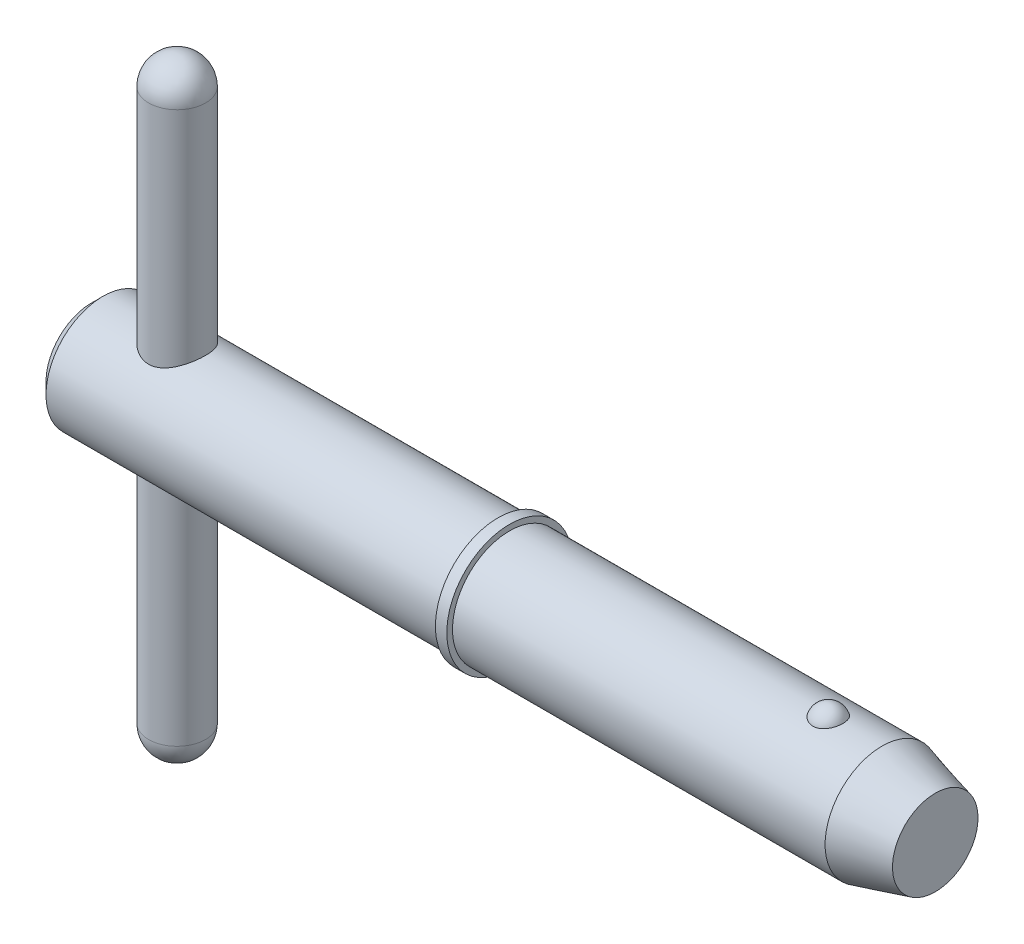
ISO-10303-21;
HEADER;
FILE_DESCRIPTION(('STEP AP214'),'2;1');
FILE_NAME('part.step','',(''),(''),'','','');
FILE_SCHEMA(('AUTOMOTIVE_DESIGN { 1 0 10303 214 1 1 1 1 }'));
ENDSEC;
DATA;
#1=APPLICATION_CONTEXT('core data for automotive mechanical design processes');
#2=APPLICATION_PROTOCOL_DEFINITION('international standard','automotive_design',2000,#1);
#3=PRODUCT_CONTEXT('',#1,'mechanical');
#4=PRODUCT('Part','Part','',(#3));
#5=PRODUCT_RELATED_PRODUCT_CATEGORY('part','',(#4));
#6=PRODUCT_DEFINITION_FORMATION('','',#4);
#7=PRODUCT_DEFINITION_CONTEXT('part definition',#1,'design');
#8=PRODUCT_DEFINITION('design','',#6,#7);
#9=PRODUCT_DEFINITION_SHAPE('','',#8);
#10=(LENGTH_UNIT() NAMED_UNIT(*) SI_UNIT(.MILLI.,.METRE.));
#11=(NAMED_UNIT(*) PLANE_ANGLE_UNIT() SI_UNIT($,.RADIAN.));
#12=(NAMED_UNIT(*) SI_UNIT($,.STERADIAN.) SOLID_ANGLE_UNIT());
#13=UNCERTAINTY_MEASURE_WITH_UNIT(LENGTH_MEASURE(1.E-05),#10,'distance_accuracy_value','');
#14=(GEOMETRIC_REPRESENTATION_CONTEXT(3) GLOBAL_UNCERTAINTY_ASSIGNED_CONTEXT((#13)) GLOBAL_UNIT_ASSIGNED_CONTEXT((#10,
#11,#12)) REPRESENTATION_CONTEXT('',''));
#15=CARTESIAN_POINT('',(0.,0.,0.));
#16=DIRECTION('',(0.,0.,1.));
#17=DIRECTION('',(1.,0.,0.));
#18=AXIS2_PLACEMENT_3D('',#15,#16,#17);
#19=CARTESIAN_POINT('',(3.57,12.7,0.));
#20=DIRECTION('',(0.,-1.,0.));
#21=DIRECTION('',(0.,0.,-1.));
#22=AXIS2_PLACEMENT_3D('',#19,#20,#21);
#23=CYLINDRICAL_SURFACE('',#22,1.19);
#24=CARTESIAN_POINT('',(3.57,-11.51,0.));
#25=DIRECTION('',(0.,-1.,0.));
#26=DIRECTION('',(0.,0.,-1.));
#27=AXIS2_PLACEMENT_3D('',#24,#25,#26);
#28=CIRCLE('',#27,1.19);
#29=CARTESIAN_POINT('',(3.57,-11.51,-1.19));
#30=VERTEX_POINT('',#29);
#31=EDGE_CURVE('P0_E10',#30,#30,#28,.F.);
#32=ORIENTED_EDGE('',*,*,#31,.T.);
#33=EDGE_LOOP('',(#32));
#34=FACE_BOUND('',#33,.T.);
#35=CARTESIAN_POINT('',(3.57,11.51,0.));
#36=DIRECTION('',(0.,-1.,0.));
#37=DIRECTION('',(0.,0.,-1.));
#38=AXIS2_PLACEMENT_3D('',#35,#36,#37);
#39=CIRCLE('',#38,1.19);
#40=CARTESIAN_POINT('',(3.57,11.51,-1.19));
#41=VERTEX_POINT('',#40);
#42=EDGE_CURVE('P0_E21',#41,#41,#39,.T.);
#43=ORIENTED_EDGE('',*,*,#42,.T.);
#44=EDGE_LOOP('',(#43));
#45=FACE_BOUND('',#44,.T.);
#46=ADVANCED_FACE('P0_F14',(#34,#45),#23,.T.);
#47=CARTESIAN_POINT('',(3.57,-11.51,0.));
#48=DIRECTION('',(0.,0.,1.));
#49=DIRECTION('',(1.,0.,0.));
#50=AXIS2_PLACEMENT_3D('',#47,#48,#49);
#51=SPHERICAL_SURFACE('',#50,1.19);
#52=CARTESIAN_POINT('',(3.57,-11.51,0.));
#53=DIRECTION('',(0.,-1.,0.));
#54=DIRECTION('',(0.,0.,-1.));
#55=AXIS2_PLACEMENT_3D('',#52,#53,#54);
#56=SPHERICAL_SURFACE('',#55,1.19);
#57=ORIENTED_EDGE('',*,*,#31,.F.);
#58=EDGE_LOOP('',(#57));
#59=FACE_BOUND('',#58,.T.);
#60=ADVANCED_FACE('P0_F29',(#59),#56,.T.);
#61=CARTESIAN_POINT('',(3.57,11.51,0.));
#62=DIRECTION('',(0.,0.,1.));
#63=DIRECTION('',(1.,0.,0.));
#64=AXIS2_PLACEMENT_3D('',#61,#62,#63);
#65=SPHERICAL_SURFACE('',#64,1.19);
#66=CARTESIAN_POINT('',(3.57,11.51,0.));
#67=DIRECTION('',(0.,-1.,0.));
#68=DIRECTION('',(0.,0.,-1.));
#69=AXIS2_PLACEMENT_3D('',#66,#67,#68);
#70=SPHERICAL_SURFACE('',#69,1.19);
#71=ORIENTED_EDGE('',*,*,#42,.F.);
#72=EDGE_LOOP('',(#71));
#73=FACE_BOUND('',#72,.T.);
#74=ADVANCED_FACE('P0_F16',(#73),#70,.T.);
#75=CLOSED_SHELL('',(#46,#60,#74));
#76=MANIFOLD_SOLID_BREP('P0_B1',#75);
#77=CARTESIAN_POINT('',(0.,0.,0.));
#78=DIRECTION('',(1.,0.,0.));
#79=DIRECTION('',(0.,0.,-1.));
#80=AXIS2_PLACEMENT_3D('',#77,#78,#79);
#81=CYLINDRICAL_SURFACE('',#80,2.38);
#82=CARTESIAN_POINT('',(33.0094297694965,0.,0.));
#83=DIRECTION('',(1.,0.,0.));
#84=DIRECTION('',(0.,0.,-1.));
#85=AXIS2_PLACEMENT_3D('',#82,#83,#84);
#86=CIRCLE('',#85,2.38);
#87=CARTESIAN_POINT('',(33.0094297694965,0.,-2.38));
#88=VERTEX_POINT('',#87);
#89=EDGE_CURVE('P1_E81',#88,#88,#86,.T.);
#90=ORIENTED_EDGE('',*,*,#89,.F.);
#91=EDGE_LOOP('',(#90));
#92=FACE_BOUND('',#91,.T.);
#93=CARTESIAN_POINT('',(17.45,0.,0.));
#94=DIRECTION('',(1.,0.,0.));
#95=DIRECTION('',(0.,0.,-1.));
#96=AXIS2_PLACEMENT_3D('',#93,#94,#95);
#97=CIRCLE('',#96,2.38);
#98=CARTESIAN_POINT('',(17.45,0.,-2.38));
#99=VERTEX_POINT('',#98);
#100=EDGE_CURVE('P1_E85',#99,#99,#97,.T.);
#101=ORIENTED_EDGE('',*,*,#100,.T.);
#102=EDGE_LOOP('',(#101));
#103=FACE_BOUND('',#102,.T.);
#104=CARTESIAN_POINT('',(30.7634492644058,2.2921568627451,0.640637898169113));
#105=CARTESIAN_POINT('',(30.7303559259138,2.29215737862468,0.640637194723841));
#106=CARTESIAN_POINT('',(30.6972546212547,2.29293179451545,0.637884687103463));
#107=CARTESIAN_POINT('',(30.6320176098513,2.29594030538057,0.626968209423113));
#108=CARTESIAN_POINT('',(30.5998823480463,2.29817506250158,0.618801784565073));
#109=CARTESIAN_POINT('',(30.5375402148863,2.3038430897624,0.597351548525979));
#110=CARTESIAN_POINT('',(30.5073305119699,2.30727454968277,0.584075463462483));
#111=CARTESIAN_POINT('',(30.4495674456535,2.31495941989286,0.552829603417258));
#112=CARTESIAN_POINT('',(30.4220141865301,2.31921286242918,0.534859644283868));
#113=CARTESIAN_POINT('',(30.3695938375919,2.32820213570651,0.494282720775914));
#114=CARTESIAN_POINT('',(30.3448050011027,2.33294694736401,0.471576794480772));
#115=CARTESIAN_POINT('',(30.2992169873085,2.34234144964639,0.422446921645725));
#116=CARTESIAN_POINT('',(30.2784185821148,2.34699112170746,0.396022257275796));
#117=CARTESIAN_POINT('',(30.2403580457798,2.35593942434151,0.338855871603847));
#118=CARTESIAN_POINT('',(30.2233051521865,2.36021170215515,0.307970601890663));
#119=CARTESIAN_POINT('',(30.1943607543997,2.3677057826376,0.243750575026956));
#120=CARTESIAN_POINT('',(30.1824701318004,2.37092740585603,0.210415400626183));
#121=CARTESIAN_POINT('',(30.1638076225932,2.37606901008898,0.141189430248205));
#122=CARTESIAN_POINT('',(30.1571956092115,2.37794816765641,0.105252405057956));
#123=CARTESIAN_POINT('',(30.1498095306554,2.38005135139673,0.0327351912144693));
#124=CARTESIAN_POINT('',(30.1490358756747,2.38027526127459,-0.00384504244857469));
#125=CARTESIAN_POINT('',(30.1533628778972,2.37903842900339,-0.0769838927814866));
#126=CARTESIAN_POINT('',(30.1585202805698,2.37756141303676,-0.113538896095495));
#127=CARTESIAN_POINT('',(30.1747013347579,2.37305303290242,-0.185229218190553));
#128=CARTESIAN_POINT('',(30.1857251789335,2.37002161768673,-0.220364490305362));
#129=CARTESIAN_POINT('',(30.2133977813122,2.36273722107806,-0.288156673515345));
#130=CARTESIAN_POINT('',(30.2300389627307,2.35848588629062,-0.320816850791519));
#131=CARTESIAN_POINT('',(30.2685984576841,2.34923130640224,-0.382744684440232));
#132=CARTESIAN_POINT('',(30.290516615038,2.34422808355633,-0.412012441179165));
#133=CARTESIAN_POINT('',(30.3387549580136,2.33412555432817,-0.465830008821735));
#134=CARTESIAN_POINT('',(30.3650028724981,2.32902887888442,-0.490444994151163));
#135=CARTESIAN_POINT('',(30.4214769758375,2.31926941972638,-0.534700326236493));
#136=CARTESIAN_POINT('',(30.451702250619,2.3146065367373,-0.554341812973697));
#137=CARTESIAN_POINT('',(30.5140618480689,2.30645675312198,-0.587312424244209));
#138=CARTESIAN_POINT('',(30.5460780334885,2.30293152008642,-0.600855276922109));
#139=CARTESIAN_POINT('',(30.6120795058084,2.29725171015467,-0.622220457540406));
#140=CARTESIAN_POINT('',(30.6460641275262,2.29509667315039,-0.630044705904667));
#141=CARTESIAN_POINT('',(30.713299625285,2.29249264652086,-0.639452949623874));
#142=CARTESIAN_POINT('',(30.7465087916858,2.29196755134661,-0.641315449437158));
#143=CARTESIAN_POINT('',(30.812763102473,2.29246849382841,-0.639522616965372));
#144=CARTESIAN_POINT('',(30.8458082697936,2.29349430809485,-0.635868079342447));
#145=CARTESIAN_POINT('',(30.9101025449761,2.29694059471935,-0.623301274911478));
#146=CARTESIAN_POINT('',(30.9413744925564,2.29933234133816,-0.614497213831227));
#147=CARTESIAN_POINT('',(31.0019952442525,2.30522511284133,-0.592006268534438));
#148=CARTESIAN_POINT('',(31.0313438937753,2.30872622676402,-0.57831899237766));
#149=CARTESIAN_POINT('',(31.0880369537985,2.31655795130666,-0.546112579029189));
#150=CARTESIAN_POINT('',(31.115320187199,2.32090569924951,-0.527490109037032));
#151=CARTESIAN_POINT('',(31.1664904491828,2.32992206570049,-0.486117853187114));
#152=CARTESIAN_POINT('',(31.1903767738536,2.33459075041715,-0.463367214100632));
#153=CARTESIAN_POINT('',(31.2352722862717,2.34399834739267,-0.413220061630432));
#154=CARTESIAN_POINT('',(31.2560972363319,2.34873051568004,-0.385657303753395));
#155=CARTESIAN_POINT('',(31.293056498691,2.35754932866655,-0.327455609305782));
#156=CARTESIAN_POINT('',(31.3091898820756,2.36163584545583,-0.296816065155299));
#157=CARTESIAN_POINT('',(31.3369822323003,2.36889321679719,-0.232047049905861));
#158=CARTESIAN_POINT('',(31.3484450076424,2.37202275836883,-0.197828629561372));
#159=CARTESIAN_POINT('',(31.3657523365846,2.37681926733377,-0.127900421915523));
#160=CARTESIAN_POINT('',(31.3715962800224,2.37848607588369,-0.0921904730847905));
#161=CARTESIAN_POINT('',(31.377605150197,2.38020024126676,-0.0196348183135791));
#162=CARTESIAN_POINT('',(31.3776704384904,2.38021918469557,0.0172198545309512));
#163=CARTESIAN_POINT('',(31.3718689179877,2.37856356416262,0.0904219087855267));
#164=CARTESIAN_POINT('',(31.3660018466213,2.37688892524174,0.12676926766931));
#165=CARTESIAN_POINT('',(31.348425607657,2.37201688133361,0.198028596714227));
#166=CARTESIAN_POINT('',(31.3366998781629,2.36881516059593,0.232936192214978));
#167=CARTESIAN_POINT('',(31.3076354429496,2.36123444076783,0.300196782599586));
#168=CARTESIAN_POINT('',(31.2902967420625,2.3568554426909,0.332549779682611));
#169=CARTESIAN_POINT('',(31.2505350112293,2.34744667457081,0.393495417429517));
#170=CARTESIAN_POINT('',(31.2281528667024,2.34242227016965,0.422115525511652));
#171=CARTESIAN_POINT('',(31.1787391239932,2.33227293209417,0.475004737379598));
#172=CARTESIAN_POINT('',(31.1517076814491,2.32714800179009,0.499273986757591));
#173=CARTESIAN_POINT('',(31.0944988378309,2.31755359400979,0.542046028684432));
#174=CARTESIAN_POINT('',(31.0644297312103,2.3130698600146,0.560690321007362));
#175=CARTESIAN_POINT('',(31.0013869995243,2.30514125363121,0.592447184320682));
#176=CARTESIAN_POINT('',(30.9684158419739,2.30169550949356,0.605564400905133));
#177=CARTESIAN_POINT('',(30.9068424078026,2.29677744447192,0.623927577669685));
#178=CARTESIAN_POINT('',(30.8785555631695,2.295058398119,0.630178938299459));
#179=CARTESIAN_POINT('',(30.8213308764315,2.29274795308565,0.638534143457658));
#180=CARTESIAN_POINT('',(30.7923931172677,2.29215641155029,0.640638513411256));
#181=CARTESIAN_POINT('',(30.7634492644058,2.2921568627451,0.640637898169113));
#182=B_SPLINE_CURVE_WITH_KNOTS('',3,(#104,#105,#106,#107,#108,#109,#110,#111,#112,#113,#114,
#115,#116,#117,#118,#119,#120,#121,#122,#123,#124,#125,#126,#127,#128,#129,#130,#131,#132,#133,
#134,#135,#136,#137,#138,#139,#140,#141,#142,#143,#144,#145,#146,#147,#148,#149,#150,#151,#152,
#153,#154,#155,#156,#157,#158,#159,#160,#161,#162,#163,#164,#165,#166,#167,#168,#169,#170,#171,
#172,#173,#174,#175,#176,#177,#178,#179,#180,#181),.UNSPECIFIED.,.T.,.F.,(4,2,2,2,2,2,2,2,2,2,2,
2,2,2,2,2,2,2,2,2,2,2,2,2,2,2,2,2,2,2,2,2,2,2,2,2,2,2,4),(0.,0.0991724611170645,
0.19838992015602,0.297457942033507,0.396529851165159,0.49792776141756,0.599345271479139,
0.705475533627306,0.811623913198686,0.920876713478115,1.03013718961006,1.14045177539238,
1.25076998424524,1.36093998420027,1.47110672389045,1.57959248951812,1.68805336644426,
1.79234266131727,1.89659691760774,1.99590391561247,2.09519661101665,2.19247425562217,
2.28975970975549,2.38926978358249,2.48880044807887,2.59293588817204,2.69709193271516,
2.80525821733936,2.91343624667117,3.02347917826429,3.13352698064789,3.24388765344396,
3.35424823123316,3.46374443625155,3.5732369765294,3.67968690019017,3.78604717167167,
3.87279565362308,3.9595331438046),.UNSPECIFIED.);
#183=CARTESIAN_POINT('',(30.7634492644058,2.2921568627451,0.640637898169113));
#184=VERTEX_POINT('',#183);
#185=EDGE_CURVE('P1_E35',#184,#184,#182,.T.);
#186=ORIENTED_EDGE('',*,*,#185,.T.);
#187=EDGE_LOOP('',(#186));
#188=FACE_BOUND('',#187,.T.);
#189=ADVANCED_FACE('P1_F13',(#92,#103,#188),#81,.T.);
#190=CARTESIAN_POINT('',(0.,0.,0.));
#191=DIRECTION('',(-1.,0.,0.));
#192=DIRECTION('',(0.,0.,1.));
#193=AXIS2_PLACEMENT_3D('',#190,#191,#192);
#194=PLANE('',#193);
#195=CARTESIAN_POINT('',(0.,0.,0.));
#196=DIRECTION('',(1.,0.,0.));
#197=DIRECTION('',(0.,0.,-1.));
#198=AXIS2_PLACEMENT_3D('',#195,#196,#197);
#199=CIRCLE('',#198,1.904);
#200=CARTESIAN_POINT('',(0.,0.,-1.904));
#201=VERTEX_POINT('',#200);
#202=EDGE_CURVE('P1_E9',#201,#201,#199,.T.);
#203=ORIENTED_EDGE('',*,*,#202,.F.);
#204=EDGE_LOOP('',(#203));
#205=FACE_BOUND('',#204,.T.);
#206=ADVANCED_FACE('P1_F15',(#205),#194,.T.);
#207=CARTESIAN_POINT('',(0.475999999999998,0.,0.));
#208=DIRECTION('',(1.,0.,0.));
#209=DIRECTION('',(0.,0.,-1.));
#210=AXIS2_PLACEMENT_3D('',#207,#208,#209);
#211=CONICAL_SURFACE('',#210,2.38,0.78539816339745);
#212=ORIENTED_EDGE('',*,*,#202,.T.);
#213=EDGE_LOOP('',(#212));
#214=FACE_BOUND('',#213,.T.);
#215=CARTESIAN_POINT('',(0.475999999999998,0.,0.));
#216=DIRECTION('',(1.,0.,0.));
#217=DIRECTION('',(0.,0.,-1.));
#218=AXIS2_PLACEMENT_3D('',#215,#216,#217);
#219=CIRCLE('',#218,2.38);
#220=CARTESIAN_POINT('',(0.475999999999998,0.,-2.38));
#221=VERTEX_POINT('',#220);
#222=EDGE_CURVE('P1_E26',#221,#221,#219,.T.);
#223=ORIENTED_EDGE('',*,*,#222,.F.);
#224=EDGE_LOOP('',(#223));
#225=FACE_BOUND('',#224,.T.);
#226=ADVANCED_FACE('P1_F77',(#214,#225),#211,.T.);
#227=CARTESIAN_POINT('',(0.,0.,0.));
#228=DIRECTION('',(1.,0.,0.));
#229=DIRECTION('',(0.,0.,-1.));
#230=AXIS2_PLACEMENT_3D('',#227,#228,#229);
#231=CYLINDRICAL_SURFACE('',#230,2.38);
#232=CARTESIAN_POINT('',(3.57,-2.06114046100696,1.19));
#233=CARTESIAN_POINT('',(3.50799170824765,-2.06114586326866,1.18999567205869));
#234=CARTESIAN_POINT('',(3.4459051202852,-2.0639812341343,1.18512096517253));
#235=CARTESIAN_POINT('',(3.32363755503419,-2.07491216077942,1.16587061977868));
#236=CARTESIAN_POINT('',(3.26346086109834,-2.08301876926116,1.15147501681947));
#237=CARTESIAN_POINT('',(3.14701251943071,-2.10331722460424,1.11395893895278));
#238=CARTESIAN_POINT('',(3.09072196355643,-2.1154873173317,1.09088484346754));
#239=CARTESIAN_POINT('',(2.9828251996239,-2.14250771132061,1.03680835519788));
#240=CARTESIAN_POINT('',(2.93121924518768,-2.15735815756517,1.00580553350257));
#241=CARTESIAN_POINT('',(2.82945618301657,-2.18956274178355,0.933753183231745));
#242=CARTESIAN_POINT('',(2.77976962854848,-2.20702235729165,0.892085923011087));
#243=CARTESIAN_POINT('',(2.68772401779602,-2.2416265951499,0.801172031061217));
#244=CARTESIAN_POINT('',(2.64536861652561,-2.25877105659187,0.751921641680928));
#245=CARTESIAN_POINT('',(2.56639309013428,-2.29219557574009,0.64318258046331));
#246=CARTESIAN_POINT('',(2.53035201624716,-2.30833946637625,0.583227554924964));
#247=CARTESIAN_POINT('',(2.46908238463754,-2.3365739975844,0.45714686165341));
#248=CARTESIAN_POINT('',(2.44384700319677,-2.34866719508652,0.391025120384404));
#249=CARTESIAN_POINT('',(2.40676945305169,-2.36667748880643,0.259473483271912));
#250=CARTESIAN_POINT('',(2.39410206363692,-2.37297281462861,0.194329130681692));
#251=CARTESIAN_POINT('',(2.3798023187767,-2.3800902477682,0.0625590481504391));
#252=CARTESIAN_POINT('',(2.37816328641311,-2.38091566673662,-0.00406576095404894));
#253=CARTESIAN_POINT('',(2.38564854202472,-2.37717948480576,-0.130700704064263));
#254=CARTESIAN_POINT('',(2.39384923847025,-2.37308010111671,-0.190782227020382));
#255=CARTESIAN_POINT('',(2.41912820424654,-2.360653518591,-0.308583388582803));
#256=CARTESIAN_POINT('',(2.43620713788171,-2.35232600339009,-0.366302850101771));
#257=CARTESIAN_POINT('',(2.47886825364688,-2.33206184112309,-0.478748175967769));
#258=CARTESIAN_POINT('',(2.50456481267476,-2.32007685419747,-0.533421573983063));
#259=CARTESIAN_POINT('',(2.56357346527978,-2.29357798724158,-0.637812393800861));
#260=CARTESIAN_POINT('',(2.5968882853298,-2.27906320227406,-0.687528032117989));
#261=CARTESIAN_POINT('',(2.67380546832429,-2.24724829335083,-0.785606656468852));
#262=CARTESIAN_POINT('',(2.71808260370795,-2.22981457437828,-0.833397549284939));
#263=CARTESIAN_POINT('',(2.81386177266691,-2.19500665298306,-0.921184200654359));
#264=CARTESIAN_POINT('',(2.86536931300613,-2.17763250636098,-0.961173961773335));
#265=CARTESIAN_POINT('',(2.97815134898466,-2.14371545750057,-1.03471134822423));
#266=CARTESIAN_POINT('',(3.03983836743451,-2.12729540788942,-1.06768860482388));
#267=CARTESIAN_POINT('',(3.16889582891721,-2.09886785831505,-1.12254974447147));
#268=CARTESIAN_POINT('',(3.2362602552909,-2.0868557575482,-1.14444520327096));
#269=CARTESIAN_POINT('',(3.36914526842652,-2.06994116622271,-1.1747444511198));
#270=CARTESIAN_POINT('',(3.43438893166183,-2.06455070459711,-1.18407989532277));
#271=CARTESIAN_POINT('',(3.56571759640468,-2.06010324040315,-1.1918051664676));
#272=CARTESIAN_POINT('',(3.63180197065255,-2.06104176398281,-1.19020272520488));
#273=CARTESIAN_POINT('',(3.75522816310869,-2.06862860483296,-1.17695289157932));
#274=CARTESIAN_POINT('',(3.81273554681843,-2.07464109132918,-1.16642350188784));
#275=CARTESIAN_POINT('',(3.92505766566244,-2.09075885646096,-1.1372785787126));
#276=CARTESIAN_POINT('',(3.97987152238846,-2.1008654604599,-1.1186604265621));
#277=CARTESIAN_POINT('',(4.08813948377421,-2.12458104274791,-1.07296063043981));
#278=CARTESIAN_POINT('',(4.14141303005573,-2.13833055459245,-1.04552693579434));
#279=CARTESIAN_POINT('',(4.2429084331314,-2.16765782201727,-0.983281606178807));
#280=CARTESIAN_POINT('',(4.29112767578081,-2.18323651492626,-0.948466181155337));
#281=CARTESIAN_POINT('',(4.38750473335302,-2.2168271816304,-0.867316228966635));
#282=CARTESIAN_POINT('',(4.43488860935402,-2.23489833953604,-0.82008287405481));
#283=CARTESIAN_POINT('',(4.52130056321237,-2.26973739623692,-0.718051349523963));
#284=CARTESIAN_POINT('',(4.56032581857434,-2.28650485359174,-0.663250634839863));
#285=CARTESIAN_POINT('',(4.62978273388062,-2.31742220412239,-0.545657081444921));
#286=CARTESIAN_POINT('',(4.65996041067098,-2.33149133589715,-0.482691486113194));
#287=CARTESIAN_POINT('',(4.7089941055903,-2.35481192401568,-0.351671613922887));
#288=CARTESIAN_POINT('',(4.7278600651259,-2.36406760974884,-0.283621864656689));
#289=CARTESIAN_POINT('',(4.75210859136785,-2.3760433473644,-0.151105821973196));
#290=CARTESIAN_POINT('',(4.75856947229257,-2.37928514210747,-0.0868836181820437));
#291=CARTESIAN_POINT('',(4.76100348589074,-2.38050135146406,0.0417999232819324));
#292=CARTESIAN_POINT('',(4.75698028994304,-2.37847760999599,0.106261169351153));
#293=CARTESIAN_POINT('',(4.73927447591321,-2.36969422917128,0.229120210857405));
#294=CARTESIAN_POINT('',(4.72624582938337,-2.36325544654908,0.287637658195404));
#295=CARTESIAN_POINT('',(4.69178087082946,-2.34658591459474,0.401560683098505));
#296=CARTESIAN_POINT('',(4.67034335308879,-2.33635462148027,0.456965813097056));
#297=CARTESIAN_POINT('',(4.61871480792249,-2.31247857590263,0.565753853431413));
#298=CARTESIAN_POINT('',(4.58818860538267,-2.29870654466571,0.618948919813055));
#299=CARTESIAN_POINT('',(4.51967006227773,-2.26918878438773,0.719681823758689));
#300=CARTESIAN_POINT('',(4.48167429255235,-2.25344215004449,0.76721704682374));
#301=CARTESIAN_POINT('',(4.39491140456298,-2.21969046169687,0.860267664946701));
#302=CARTESIAN_POINT('',(4.34544863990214,-2.20161660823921,0.905111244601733));
#303=CARTESIAN_POINT('',(4.23943364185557,-2.16655060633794,0.986109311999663));
#304=CARTESIAN_POINT('',(4.18287520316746,-2.1495594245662,1.02225611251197));
#305=CARTESIAN_POINT('',(4.06190239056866,-2.1181953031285,1.08579298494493));
#306=CARTESIAN_POINT('',(3.9972962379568,-2.10392207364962,1.11287022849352));
#307=CARTESIAN_POINT('',(3.86353443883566,-2.08090726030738,1.15534566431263));
#308=CARTESIAN_POINT('',(3.7943948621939,-2.07214719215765,1.17078291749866));
#309=CARTESIAN_POINT('',(3.69875162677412,-2.06499834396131,1.18329673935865));
#310=CARTESIAN_POINT('',(3.67309220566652,-2.06355673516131,1.18580656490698));
#311=CARTESIAN_POINT('',(3.62162638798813,-2.06162663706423,1.18915915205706));
#312=CARTESIAN_POINT('',(3.59581998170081,-2.0611382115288,1.19000180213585));
#313=CARTESIAN_POINT('',(3.57,-2.06114046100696,1.19));
#314=B_SPLINE_CURVE_WITH_KNOTS('',3,(#232,#233,#234,#235,#236,#237,#238,#239,#240,#241,#242,
#243,#244,#245,#246,#247,#248,#249,#250,#251,#252,#253,#254,#255,#256,#257,#258,#259,#260,#261,
#262,#263,#264,#265,#266,#267,#268,#269,#270,#271,#272,#273,#274,#275,#276,#277,#278,#279,#280,
#281,#282,#283,#284,#285,#286,#287,#288,#289,#290,#291,#292,#293,#294,#295,#296,#297,#298,#299,
#300,#301,#302,#303,#304,#305,#306,#307,#308,#309,#310,#311,#312,#313),.UNSPECIFIED.,.T.,.F.,(4,
2,2,2,2,2,2,2,2,2,2,2,2,2,2,2,2,2,2,2,2,2,2,2,2,2,2,2,2,2,2,2,2,2,2,2,2,2,2,2,4),(0.,
0.185916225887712,0.372223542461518,0.557549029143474,0.742884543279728,0.943506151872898,
1.14422749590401,1.35847891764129,1.5725948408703,1.77147547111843,1.97023568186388,
2.15171156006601,2.33320101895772,2.51720146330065,2.70126786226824,2.902733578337,
3.10435357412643,3.31877721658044,3.53297641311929,3.73020126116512,3.92728670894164,
4.1028127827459,4.27839572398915,4.46211082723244,4.64592048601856,4.8529002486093,
5.0599497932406,5.27246375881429,5.48479067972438,5.67763601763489,5.87041383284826,
6.05048865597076,6.23058930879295,6.41839293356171,6.60628297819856,6.8128718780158,
7.01964271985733,7.2329479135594,7.44553408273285,7.52294360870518,7.60035831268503),.UNSPECIFIED.);
#315=CARTESIAN_POINT('',(3.57,-2.06114046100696,1.19));
#316=VERTEX_POINT('',#315);
#317=EDGE_CURVE('P1_E17',#316,#316,#314,.T.);
#318=ORIENTED_EDGE('',*,*,#317,.F.);
#319=EDGE_LOOP('',(#318));
#320=FACE_BOUND('',#319,.T.);
#321=CARTESIAN_POINT('',(3.57,2.06114046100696,1.19));
#322=CARTESIAN_POINT('',(3.63200829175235,2.06114586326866,1.18999567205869));
#323=CARTESIAN_POINT('',(3.6940948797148,2.0639812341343,1.18512096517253));
#324=CARTESIAN_POINT('',(3.81636244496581,2.07491216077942,1.16587061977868));
#325=CARTESIAN_POINT('',(3.87653913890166,2.08301876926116,1.15147501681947));
#326=CARTESIAN_POINT('',(3.99298748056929,2.10331722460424,1.11395893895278));
#327=CARTESIAN_POINT('',(4.04927803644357,2.1154873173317,1.09088484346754));
#328=CARTESIAN_POINT('',(4.1571748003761,2.14250771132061,1.03680835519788));
#329=CARTESIAN_POINT('',(4.20878075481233,2.15735815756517,1.00580553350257));
#330=CARTESIAN_POINT('',(4.31054381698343,2.18956274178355,0.933753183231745));
#331=CARTESIAN_POINT('',(4.36023037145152,2.20702235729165,0.892085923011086));
#332=CARTESIAN_POINT('',(4.45227598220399,2.2416265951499,0.801172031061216));
#333=CARTESIAN_POINT('',(4.49463138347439,2.25877105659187,0.751921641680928));
#334=CARTESIAN_POINT('',(4.57360690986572,2.29219557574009,0.643182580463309));
#335=CARTESIAN_POINT('',(4.60964798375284,2.30833946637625,0.583227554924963));
#336=CARTESIAN_POINT('',(4.67091761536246,2.3365739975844,0.457146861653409));
#337=CARTESIAN_POINT('',(4.69615299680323,2.34866719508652,0.391025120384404));
#338=CARTESIAN_POINT('',(4.73323054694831,2.36667748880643,0.259473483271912));
#339=CARTESIAN_POINT('',(4.74589793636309,2.37297281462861,0.194329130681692));
#340=CARTESIAN_POINT('',(4.7601976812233,2.3800902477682,0.0625590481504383));
#341=CARTESIAN_POINT('',(4.76183671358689,2.38091566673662,-0.00406576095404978));
#342=CARTESIAN_POINT('',(4.75435145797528,2.37717948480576,-0.130700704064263));
#343=CARTESIAN_POINT('',(4.74615076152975,2.37308010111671,-0.190782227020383));
#344=CARTESIAN_POINT('',(4.72087179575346,2.360653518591,-0.308583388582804));
#345=CARTESIAN_POINT('',(4.70379286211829,2.35232600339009,-0.366302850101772));
#346=CARTESIAN_POINT('',(4.66113174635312,2.33206184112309,-0.478748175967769));
#347=CARTESIAN_POINT('',(4.63543518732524,2.32007685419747,-0.533421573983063));
#348=CARTESIAN_POINT('',(4.57642653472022,2.29357798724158,-0.637812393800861));
#349=CARTESIAN_POINT('',(4.5431117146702,2.27906320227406,-0.687528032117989));
#350=CARTESIAN_POINT('',(4.46619453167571,2.24724829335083,-0.785606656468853));
#351=CARTESIAN_POINT('',(4.42191739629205,2.22981457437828,-0.83339754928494));
#352=CARTESIAN_POINT('',(4.32613822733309,2.19500665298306,-0.921184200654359));
#353=CARTESIAN_POINT('',(4.27463068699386,2.17763250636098,-0.961173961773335));
#354=CARTESIAN_POINT('',(4.16184865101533,2.14371545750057,-1.03471134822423));
#355=CARTESIAN_POINT('',(4.10016163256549,2.12729540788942,-1.06768860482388));
#356=CARTESIAN_POINT('',(3.97110417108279,2.09886785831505,-1.12254974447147));
#357=CARTESIAN_POINT('',(3.9037397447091,2.0868557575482,-1.14444520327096));
#358=CARTESIAN_POINT('',(3.77085473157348,2.06994116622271,-1.1747444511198));
#359=CARTESIAN_POINT('',(3.70561106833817,2.06455070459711,-1.18407989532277));
#360=CARTESIAN_POINT('',(3.57428240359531,2.06010324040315,-1.1918051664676));
#361=CARTESIAN_POINT('',(3.50819802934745,2.06104176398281,-1.19020272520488));
#362=CARTESIAN_POINT('',(3.38477183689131,2.06862860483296,-1.17695289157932));
#363=CARTESIAN_POINT('',(3.32726445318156,2.07464109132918,-1.16642350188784));
#364=CARTESIAN_POINT('',(3.21494233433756,2.09075885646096,-1.1372785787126));
#365=CARTESIAN_POINT('',(3.16012847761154,2.1008654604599,-1.1186604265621));
#366=CARTESIAN_POINT('',(3.05186051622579,2.12458104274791,-1.07296063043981));
#367=CARTESIAN_POINT('',(2.99858696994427,2.13833055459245,-1.04552693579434));
#368=CARTESIAN_POINT('',(2.8970915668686,2.16765782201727,-0.983281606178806));
#369=CARTESIAN_POINT('',(2.84887232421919,2.18323651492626,-0.948466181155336));
#370=CARTESIAN_POINT('',(2.75249526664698,2.2168271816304,-0.867316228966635));
#371=CARTESIAN_POINT('',(2.70511139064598,2.23489833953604,-0.820082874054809));
#372=CARTESIAN_POINT('',(2.61869943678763,2.26973739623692,-0.718051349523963));
#373=CARTESIAN_POINT('',(2.57967418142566,2.28650485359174,-0.663250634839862));
#374=CARTESIAN_POINT('',(2.51021726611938,2.31742220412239,-0.54565708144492));
#375=CARTESIAN_POINT('',(2.48003958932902,2.33149133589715,-0.482691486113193));
#376=CARTESIAN_POINT('',(2.4310058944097,2.35481192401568,-0.351671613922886));
#377=CARTESIAN_POINT('',(2.4121399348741,2.36406760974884,-0.283621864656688));
#378=CARTESIAN_POINT('',(2.38789140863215,2.3760433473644,-0.151105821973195));
#379=CARTESIAN_POINT('',(2.38143052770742,2.37928514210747,-0.0868836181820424));
#380=CARTESIAN_POINT('',(2.37899651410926,2.38050135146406,0.0417999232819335));
#381=CARTESIAN_POINT('',(2.38301971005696,2.37847760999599,0.106261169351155));
#382=CARTESIAN_POINT('',(2.40072552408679,2.36969422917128,0.229120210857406));
#383=CARTESIAN_POINT('',(2.41375417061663,2.36325544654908,0.287637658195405));
#384=CARTESIAN_POINT('',(2.44821912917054,2.34658591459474,0.401560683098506));
#385=CARTESIAN_POINT('',(2.46965664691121,2.33635462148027,0.456965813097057));
#386=CARTESIAN_POINT('',(2.52128519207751,2.31247857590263,0.565753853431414));
#387=CARTESIAN_POINT('',(2.55181139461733,2.29870654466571,0.618948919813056));
#388=CARTESIAN_POINT('',(2.62032993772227,2.26918878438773,0.719681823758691));
#389=CARTESIAN_POINT('',(2.65832570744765,2.25344215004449,0.767217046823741));
#390=CARTESIAN_POINT('',(2.74508859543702,2.21969046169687,0.860267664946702));
#391=CARTESIAN_POINT('',(2.79455136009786,2.20161660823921,0.905111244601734));
#392=CARTESIAN_POINT('',(2.90056635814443,2.16655060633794,0.986109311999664));
#393=CARTESIAN_POINT('',(2.95712479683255,2.1495594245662,1.02225611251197));
#394=CARTESIAN_POINT('',(3.07809760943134,2.1181953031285,1.08579298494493));
#395=CARTESIAN_POINT('',(3.1427037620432,2.10392207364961,1.11287022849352));
#396=CARTESIAN_POINT('',(3.27646556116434,2.08090726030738,1.15534566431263));
#397=CARTESIAN_POINT('',(3.3456051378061,2.07214719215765,1.17078291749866));
#398=CARTESIAN_POINT('',(3.44124837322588,2.06499834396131,1.18329673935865));
#399=CARTESIAN_POINT('',(3.46690779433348,2.06355673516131,1.18580656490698));
#400=CARTESIAN_POINT('',(3.51837361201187,2.06162663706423,1.18915915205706));
#401=CARTESIAN_POINT('',(3.54418001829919,2.0611382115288,1.19000180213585));
#402=CARTESIAN_POINT('',(3.57,2.06114046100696,1.19));
#403=B_SPLINE_CURVE_WITH_KNOTS('',3,(#321,#322,#323,#324,#325,#326,#327,#328,#329,#330,#331,
#332,#333,#334,#335,#336,#337,#338,#339,#340,#341,#342,#343,#344,#345,#346,#347,#348,#349,#350,
#351,#352,#353,#354,#355,#356,#357,#358,#359,#360,#361,#362,#363,#364,#365,#366,#367,#368,#369,
#370,#371,#372,#373,#374,#375,#376,#377,#378,#379,#380,#381,#382,#383,#384,#385,#386,#387,#388,
#389,#390,#391,#392,#393,#394,#395,#396,#397,#398,#399,#400,#401,#402),.UNSPECIFIED.,.T.,.F.,(4,
2,2,2,2,2,2,2,2,2,2,2,2,2,2,2,2,2,2,2,2,2,2,2,2,2,2,2,2,2,2,2,2,2,2,2,2,2,2,2,4),(0.,
0.185916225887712,0.372223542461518,0.557549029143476,0.74288454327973,0.9435061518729,
1.14422749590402,1.35847891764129,1.5725948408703,1.77147547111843,1.97023568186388,
2.15171156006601,2.33320101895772,2.51720146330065,2.70126786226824,2.902733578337,
3.10435357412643,3.31877721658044,3.53297641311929,3.73020126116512,3.92728670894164,
4.1028127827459,4.27839572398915,4.46211082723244,4.64592048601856,4.8529002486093,
5.05994979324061,5.27246375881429,5.48479067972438,5.67763601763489,5.87041383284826,
6.05048865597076,6.23058930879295,6.41839293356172,6.60628297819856,6.8128718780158,
7.01964271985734,7.2329479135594,7.44553408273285,7.52294360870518,7.60035831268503),.UNSPECIFIED.);
#404=CARTESIAN_POINT('',(3.57,2.06114046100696,1.19));
#405=VERTEX_POINT('',#404);
#406=EDGE_CURVE('P1_E43',#405,#405,#403,.T.);
#407=ORIENTED_EDGE('',*,*,#406,.F.);
#408=EDGE_LOOP('',(#407));
#409=FACE_BOUND('',#408,.T.);
#410=ORIENTED_EDGE('',*,*,#222,.T.);
#411=EDGE_LOOP('',(#410));
#412=FACE_BOUND('',#411,.T.);
#413=CARTESIAN_POINT('',(16.974,0.,0.));
#414=DIRECTION('',(1.,0.,0.));
#415=DIRECTION('',(0.,0.,-1.));
#416=AXIS2_PLACEMENT_3D('',#413,#414,#415);
#417=CIRCLE('',#416,2.38);
#418=CARTESIAN_POINT('',(16.974,0.,-2.38));
#419=VERTEX_POINT('',#418);
#420=EDGE_CURVE('P1_E31',#419,#419,#417,.T.);
#421=ORIENTED_EDGE('',*,*,#420,.F.);
#422=EDGE_LOOP('',(#421));
#423=FACE_BOUND('',#422,.T.);
#424=ADVANCED_FACE('P1_F103',(#320,#409,#412,#423),#231,.T.);
#425=CARTESIAN_POINT('',(16.974,2.38,0.));
#426=DIRECTION('',(-1.,0.,0.));
#427=DIRECTION('',(0.,0.,1.));
#428=AXIS2_PLACEMENT_3D('',#425,#426,#427);
#429=PLANE('',#428);
#430=ORIENTED_EDGE('',*,*,#420,.T.);
#431=EDGE_LOOP('',(#430));
#432=FACE_BOUND('',#431,.T.);
#433=CARTESIAN_POINT('',(16.974,0.,0.));
#434=DIRECTION('',(1.,0.,0.));
#435=DIRECTION('',(0.,0.,-1.));
#436=AXIS2_PLACEMENT_3D('',#433,#434,#435);
#437=CIRCLE('',#436,2.618);
#438=CARTESIAN_POINT('',(16.974,0.,-2.618));
#439=VERTEX_POINT('',#438);
#440=EDGE_CURVE('P1_E91',#439,#439,#437,.T.);
#441=ORIENTED_EDGE('',*,*,#440,.F.);
#442=EDGE_LOOP('',(#441));
#443=FACE_BOUND('',#442,.T.);
#444=ADVANCED_FACE('P1_F100',(#432,#443),#429,.T.);
#445=CARTESIAN_POINT('',(0.,0.,0.));
#446=DIRECTION('',(1.,0.,0.));
#447=DIRECTION('',(0.,0.,-1.));
#448=AXIS2_PLACEMENT_3D('',#445,#446,#447);
#449=CYLINDRICAL_SURFACE('',#448,2.618);
#450=ORIENTED_EDGE('',*,*,#440,.T.);
#451=EDGE_LOOP('',(#450));
#452=FACE_BOUND('',#451,.T.);
#453=CARTESIAN_POINT('',(17.45,0.,0.));
#454=DIRECTION('',(1.,0.,0.));
#455=DIRECTION('',(0.,0.,-1.));
#456=AXIS2_PLACEMENT_3D('',#453,#454,#455);
#457=CIRCLE('',#456,2.618);
#458=CARTESIAN_POINT('',(17.45,0.,-2.618));
#459=VERTEX_POINT('',#458);
#460=EDGE_CURVE('P1_E88',#459,#459,#457,.T.);
#461=ORIENTED_EDGE('',*,*,#460,.F.);
#462=EDGE_LOOP('',(#461));
#463=FACE_BOUND('',#462,.T.);
#464=ADVANCED_FACE('P1_F68',(#452,#463),#449,.T.);
#465=CARTESIAN_POINT('',(17.45,2.618,0.));
#466=DIRECTION('',(1.,0.,0.));
#467=DIRECTION('',(0.,0.,-1.));
#468=AXIS2_PLACEMENT_3D('',#465,#466,#467);
#469=PLANE('',#468);
#470=ORIENTED_EDGE('',*,*,#460,.T.);
#471=EDGE_LOOP('',(#470));
#472=FACE_BOUND('',#471,.T.);
#473=ORIENTED_EDGE('',*,*,#100,.F.);
#474=EDGE_LOOP('',(#473));
#475=FACE_BOUND('',#474,.T.);
#476=ADVANCED_FACE('P1_F62',(#472,#475),#469,.T.);
#477=CARTESIAN_POINT('',(35.23,0.,0.));
#478=DIRECTION('',(-1.,0.,0.));
#479=DIRECTION('',(0.,0.,1.));
#480=AXIS2_PLACEMENT_3D('',#477,#478,#479);
#481=CONICAL_SURFACE('',#480,1.785,0.261799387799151);
#482=ORIENTED_EDGE('',*,*,#89,.T.);
#483=EDGE_LOOP('',(#482));
#484=FACE_BOUND('',#483,.T.);
#485=CARTESIAN_POINT('',(35.23,0.,0.));
#486=DIRECTION('',(1.,0.,0.));
#487=DIRECTION('',(0.,0.,-1.));
#488=AXIS2_PLACEMENT_3D('',#485,#486,#487);
#489=CIRCLE('',#488,1.785);
#490=CARTESIAN_POINT('',(35.23,0.,-1.785));
#491=VERTEX_POINT('',#490);
#492=EDGE_CURVE('P1_E42',#491,#491,#489,.T.);
#493=ORIENTED_EDGE('',*,*,#492,.F.);
#494=EDGE_LOOP('',(#493));
#495=FACE_BOUND('',#494,.T.);
#496=ADVANCED_FACE('P1_F59',(#484,#495),#481,.T.);
#497=CARTESIAN_POINT('',(35.23,1.785,0.));
#498=DIRECTION('',(1.,0.,0.));
#499=DIRECTION('',(0.,0.,-1.));
#500=AXIS2_PLACEMENT_3D('',#497,#498,#499);
#501=PLANE('',#500);
#502=ORIENTED_EDGE('',*,*,#492,.T.);
#503=EDGE_LOOP('',(#502));
#504=FACE_BOUND('',#503,.T.);
#505=ADVANCED_FACE('P1_F55',(#504),#501,.T.);
#506=CARTESIAN_POINT('',(30.7634492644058,2.142,0.));
#507=DIRECTION('',(-1.,0.,0.));
#508=DIRECTION('',(0.,-1.,0.));
#509=AXIS2_PLACEMENT_3D('',#506,#507,#508);
#510=SPHERICAL_SURFACE('',#509,0.657999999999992);
#511=ORIENTED_EDGE('',*,*,#185,.F.);
#512=EDGE_LOOP('',(#511));
#513=FACE_BOUND('',#512,.T.);
#514=ADVANCED_FACE('P1_F50',(#513),#510,.T.);
#515=CARTESIAN_POINT('',(3.57,-2.618,0.));
#516=DIRECTION('',(0.,1.,0.));
#517=DIRECTION('',(0.,0.,1.));
#518=AXIS2_PLACEMENT_3D('',#515,#516,#517);
#519=CYLINDRICAL_SURFACE('',#518,1.19);
#520=ORIENTED_EDGE('',*,*,#317,.T.);
#521=EDGE_LOOP('',(#520));
#522=FACE_BOUND('',#521,.T.);
#523=ORIENTED_EDGE('',*,*,#406,.T.);
#524=EDGE_LOOP('',(#523));
#525=FACE_BOUND('',#524,.T.);
#526=ADVANCED_FACE('P1_F54',(#522,#525),#519,.F.);
#527=CLOSED_SHELL('',(#189,#206,#226,#424,#444,#464,#476,#496,#505,#514,#526));
#528=MANIFOLD_SOLID_BREP('P1_B1',#527);
#529=ADVANCED_BREP_SHAPE_REPRESENTATION('',(#18,#76,#528),#14);
#530=SHAPE_DEFINITION_REPRESENTATION(#9,#529);
ENDSEC;
END-ISO-10303-21;
